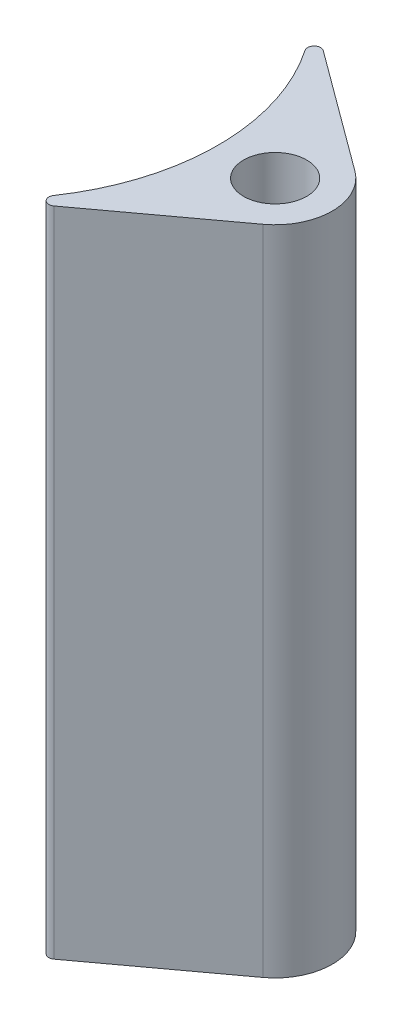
from build123d import *

# Parameters (mm, degrees)
BOSS_EXTRUDE1_DEPTH          = 50.8
F_10_0_1935_DIAMETER_HOLE1_D = 4.9149


with BuildPart() as part:
    # Sketch1 → Boss-Extrude1 (new body)
    with BuildSketch(Plane(origin=(0, 0, 0), x_dir=(1, 0, 0), z_dir=(0, 1, 0))):
        with BuildLine():
            Line((15.105633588, -10.483310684), (24.479988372, -3.579048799))
            ThreePointArc((24.479988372, -3.579048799), (26.289, 0), (24.479988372, 3.579048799))
            Line((24.479988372, 3.579048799), (15.105633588, 10.483310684))
            ThreePointArc((15.105633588, 10.483310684), (14.451927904, 10.440122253), (14.384395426, 9.788481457))
            ThreePointArc((14.384395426, 9.788481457), (17.399, 0), (14.384395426, -9.788481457))
            ThreePointArc((14.384395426, -9.788481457), (14.451927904, -10.440122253), (15.105633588, -10.483310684))
        make_face()
    extrude(amount=BOSS_EXTRUDE1_DEPTH)

    # 10 _0.1935_ Diameter Hole1 (through all)
    with Locations(Plane(origin=(0, 50.8, 0), x_dir=(1, 0, 0), z_dir=(0, 1, 0))):
        with Locations((21.844, 0)):
            Hole(F_10_0_1935_DIAMETER_HOLE1_D / 2)


solid = part.part
